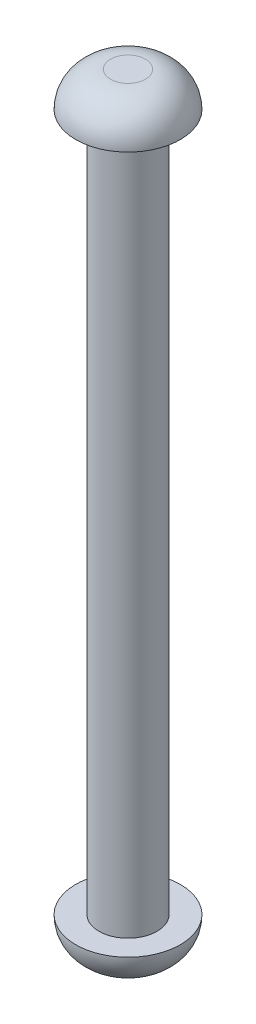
ISO-10303-21;
HEADER;
FILE_DESCRIPTION(('STEP AP214'),'2;1');
FILE_NAME('part.step','',(''),(''),'','','');
FILE_SCHEMA(('AUTOMOTIVE_DESIGN { 1 0 10303 214 1 1 1 1 }'));
ENDSEC;
DATA;
#1=APPLICATION_CONTEXT('core data for automotive mechanical design processes');
#2=APPLICATION_PROTOCOL_DEFINITION('international standard','automotive_design',2000,#1);
#3=PRODUCT_CONTEXT('',#1,'mechanical');
#4=PRODUCT('Part','Part','',(#3));
#5=PRODUCT_RELATED_PRODUCT_CATEGORY('part','',(#4));
#6=PRODUCT_DEFINITION_FORMATION('','',#4);
#7=PRODUCT_DEFINITION_CONTEXT('part definition',#1,'design');
#8=PRODUCT_DEFINITION('design','',#6,#7);
#9=PRODUCT_DEFINITION_SHAPE('','',#8);
#10=(LENGTH_UNIT() NAMED_UNIT(*) SI_UNIT(.MILLI.,.METRE.));
#11=(NAMED_UNIT(*) PLANE_ANGLE_UNIT() SI_UNIT($,.RADIAN.));
#12=(NAMED_UNIT(*) SI_UNIT($,.STERADIAN.) SOLID_ANGLE_UNIT());
#13=UNCERTAINTY_MEASURE_WITH_UNIT(LENGTH_MEASURE(1.E-05),#10,'distance_accuracy_value','');
#14=(GEOMETRIC_REPRESENTATION_CONTEXT(3) GLOBAL_UNCERTAINTY_ASSIGNED_CONTEXT((#13)) GLOBAL_UNIT_ASSIGNED_CONTEXT((#10,
#11,#12)) REPRESENTATION_CONTEXT('',''));
#15=CARTESIAN_POINT('',(0.,0.,0.));
#16=DIRECTION('',(0.,0.,1.));
#17=DIRECTION('',(1.,0.,0.));
#18=AXIS2_PLACEMENT_3D('',#15,#16,#17);
#19=CARTESIAN_POINT('',(0.,60.,0.));
#20=DIRECTION('',(0.,-1.,0.));
#21=DIRECTION('',(0.,0.,-1.));
#22=AXIS2_PLACEMENT_3D('',#19,#20,#21);
#23=CYLINDRICAL_SURFACE('',#22,2.5);
#24=CARTESIAN_POINT('',(0.,60.,0.));
#25=DIRECTION('',(0.,1.,0.));
#26=DIRECTION('',(0.,0.,1.));
#27=AXIS2_PLACEMENT_3D('',#24,#25,#26);
#28=CIRCLE('',#27,2.5);
#29=CARTESIAN_POINT('',(0.,60.,2.5));
#30=VERTEX_POINT('',#29);
#31=EDGE_CURVE('E50',#30,#30,#28,.T.);
#32=ORIENTED_EDGE('',*,*,#31,.F.);
#33=EDGE_LOOP('',(#32));
#34=FACE_BOUND('',#33,.T.);
#35=CARTESIAN_POINT('',(0.,0.,0.));
#36=DIRECTION('',(0.,1.,0.));
#37=DIRECTION('',(0.,0.,1.));
#38=AXIS2_PLACEMENT_3D('',#35,#36,#37);
#39=CIRCLE('',#38,2.5);
#40=CARTESIAN_POINT('',(0.,0.,2.5));
#41=VERTEX_POINT('',#40);
#42=EDGE_CURVE('E57',#41,#41,#39,.T.);
#43=ORIENTED_EDGE('',*,*,#42,.T.);
#44=EDGE_LOOP('',(#43));
#45=FACE_BOUND('',#44,.T.);
#46=ADVANCED_FACE('F39',(#34,#45),#23,.T.);
#47=CARTESIAN_POINT('',(0.,63.,0.));
#48=DIRECTION('',(0.,1.,0.));
#49=DIRECTION('',(0.,0.,1.));
#50=AXIS2_PLACEMENT_3D('',#47,#48,#49);
#51=PLANE('',#50);
#52=CARTESIAN_POINT('',(0.,63.,0.));
#53=DIRECTION('',(0.,1.,0.));
#54=DIRECTION('',(0.,0.,1.));
#55=AXIS2_PLACEMENT_3D('',#52,#53,#54);
#56=CIRCLE('',#55,1.5);
#57=CARTESIAN_POINT('',(0.,63.,1.5));
#58=VERTEX_POINT('',#57);
#59=EDGE_CURVE('E46',#58,#58,#56,.T.);
#60=ORIENTED_EDGE('',*,*,#59,.T.);
#61=EDGE_LOOP('',(#60));
#62=FACE_BOUND('',#61,.T.);
#63=ADVANCED_FACE('F82',(#62),#51,.T.);
#64=CARTESIAN_POINT('',(0.,60.,0.));
#65=DIRECTION('',(0.,1.,0.));
#66=DIRECTION('',(0.,0.,1.));
#67=AXIS2_PLACEMENT_3D('',#64,#65,#66);
#68=PLANE('',#67);
#69=ORIENTED_EDGE('',*,*,#31,.T.);
#70=EDGE_LOOP('',(#69));
#71=FACE_BOUND('',#70,.T.);
#72=CARTESIAN_POINT('',(0.,60.,0.));
#73=DIRECTION('',(0.,1.,0.));
#74=DIRECTION('',(0.,0.,1.));
#75=AXIS2_PLACEMENT_3D('',#72,#73,#74);
#76=CIRCLE('',#75,4.5);
#77=CARTESIAN_POINT('',(0.,60.,4.5));
#78=VERTEX_POINT('',#77);
#79=EDGE_CURVE('E54',#78,#78,#76,.T.);
#80=ORIENTED_EDGE('',*,*,#79,.F.);
#81=EDGE_LOOP('',(#80));
#82=FACE_BOUND('',#81,.T.);
#83=ADVANCED_FACE('F88',(#71,#82),#68,.F.);
#84=CARTESIAN_POINT('',(0.,60.,0.));
#85=DIRECTION('',(0.,1.,0.));
#86=DIRECTION('',(0.,0.,1.));
#87=AXIS2_PLACEMENT_3D('',#84,#85,#86);
#88=DEGENERATE_TOROIDAL_SURFACE('',#87,1.5,3.,.T.);
#89=ORIENTED_EDGE('',*,*,#79,.T.);
#90=EDGE_LOOP('',(#89));
#91=FACE_BOUND('',#90,.T.);
#92=ORIENTED_EDGE('',*,*,#59,.F.);
#93=EDGE_LOOP('',(#92));
#94=FACE_BOUND('',#93,.T.);
#95=ADVANCED_FACE('F77',(#91,#94),#88,.T.);
#96=CARTESIAN_POINT('',(0.,-3.,0.));
#97=DIRECTION('',(0.,-1.,0.));
#98=DIRECTION('',(0.,0.,-1.));
#99=AXIS2_PLACEMENT_3D('',#96,#97,#98);
#100=PLANE('',#99);
#101=CARTESIAN_POINT('',(0.,-3.,0.));
#102=DIRECTION('',(0.,-1.,0.));
#103=DIRECTION('',(0.,0.,-1.));
#104=AXIS2_PLACEMENT_3D('',#101,#102,#103);
#105=CIRCLE('',#104,1.5);
#106=CARTESIAN_POINT('',(0.,-3.,-1.5));
#107=VERTEX_POINT('',#106);
#108=EDGE_CURVE('E10',#107,#107,#105,.T.);
#109=ORIENTED_EDGE('',*,*,#108,.T.);
#110=EDGE_LOOP('',(#109));
#111=FACE_BOUND('',#110,.T.);
#112=ADVANCED_FACE('F70',(#111),#100,.T.);
#113=CARTESIAN_POINT('',(0.,0.,0.));
#114=DIRECTION('',(0.,-1.,0.));
#115=DIRECTION('',(0.,0.,-1.));
#116=AXIS2_PLACEMENT_3D('',#113,#114,#115);
#117=PLANE('',#116);
#118=ORIENTED_EDGE('',*,*,#42,.F.);
#119=EDGE_LOOP('',(#118));
#120=FACE_BOUND('',#119,.T.);
#121=CARTESIAN_POINT('',(0.,0.,0.));
#122=DIRECTION('',(0.,-1.,0.));
#123=DIRECTION('',(0.,0.,-1.));
#124=AXIS2_PLACEMENT_3D('',#121,#122,#123);
#125=CIRCLE('',#124,4.5);
#126=CARTESIAN_POINT('',(0.,0.,-4.5));
#127=VERTEX_POINT('',#126);
#128=EDGE_CURVE('E59',#127,#127,#125,.T.);
#129=ORIENTED_EDGE('',*,*,#128,.F.);
#130=EDGE_LOOP('',(#129));
#131=FACE_BOUND('',#130,.T.);
#132=ADVANCED_FACE('F68',(#120,#131),#117,.F.);
#133=CARTESIAN_POINT('',(0.,0.,0.));
#134=DIRECTION('',(0.,-1.,0.));
#135=DIRECTION('',(0.,0.,-1.));
#136=AXIS2_PLACEMENT_3D('',#133,#134,#135);
#137=DEGENERATE_TOROIDAL_SURFACE('',#136,1.5,3.,.T.);
#138=ORIENTED_EDGE('',*,*,#128,.T.);
#139=EDGE_LOOP('',(#138));
#140=FACE_BOUND('',#139,.T.);
#141=ORIENTED_EDGE('',*,*,#108,.F.);
#142=EDGE_LOOP('',(#141));
#143=FACE_BOUND('',#142,.T.);
#144=ADVANCED_FACE('F41',(#140,#143),#137,.T.);
#145=CLOSED_SHELL('',(#46,#63,#83,#95,#112,#132,#144));
#146=MANIFOLD_SOLID_BREP('B2',#145);
#147=ADVANCED_BREP_SHAPE_REPRESENTATION('',(#18,#146),#14);
#148=SHAPE_DEFINITION_REPRESENTATION(#9,#147);
ENDSEC;
END-ISO-10303-21;
